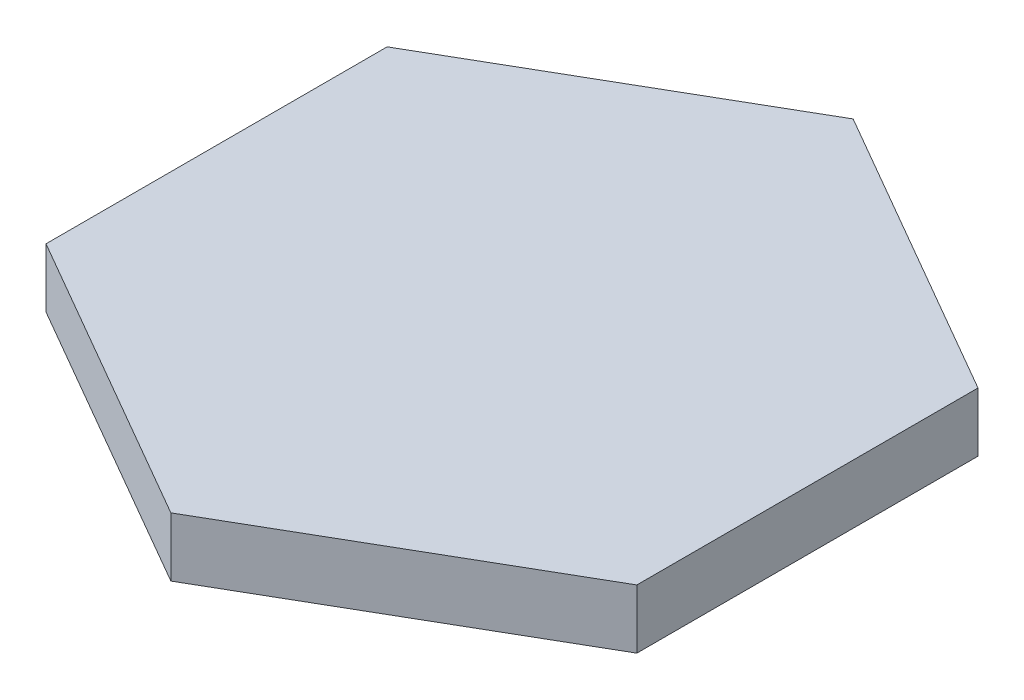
from build123d import *

# Parameters (mm, degrees)
EXTRUDE1_DEPTH = 12


with BuildPart() as part:
    # Sketch1 → Extrude1 (new body)
    with BuildSketch(Plane(origin=(0, 0, 0), x_dir=(1, 0, 0), z_dir=(0, 1, 0))):
        Polygon((0, 69.282032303), (-60, 34.641016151), (-60, -34.641016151), (0, -69.282032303), (60, -34.641016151), (60, 34.641016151), align=None)
    extrude(amount=-EXTRUDE1_DEPTH)


solid = part.part
